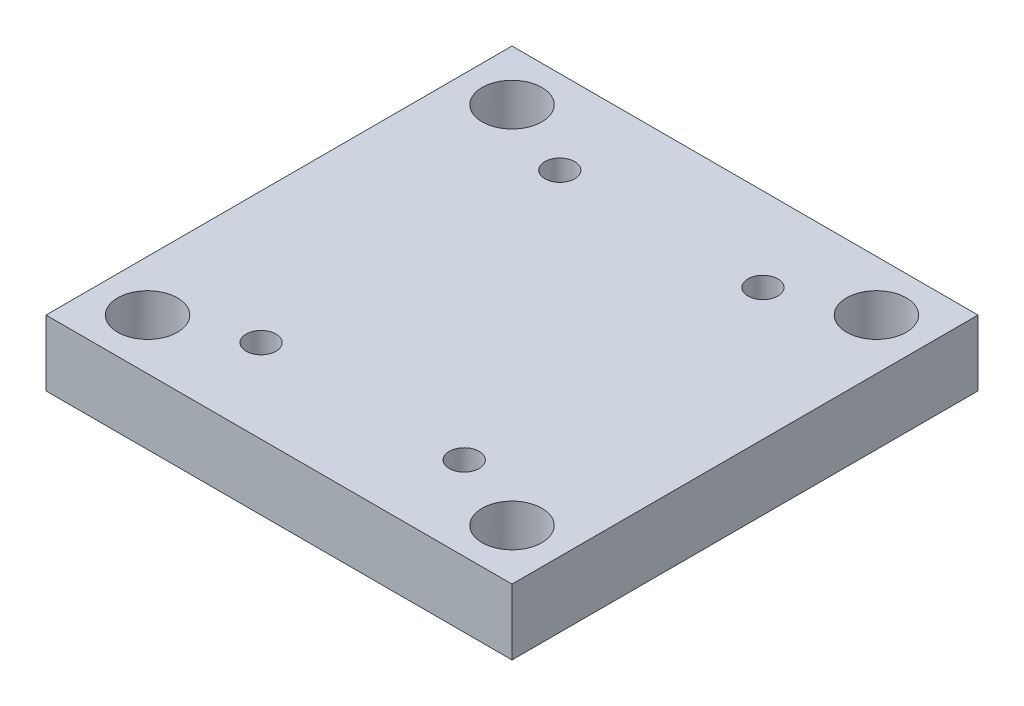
ISO-10303-21;
HEADER;
FILE_DESCRIPTION(('STEP AP214'),'2;1');
FILE_NAME('part.step','',(''),(''),'','','');
FILE_SCHEMA(('AUTOMOTIVE_DESIGN { 1 0 10303 214 1 1 1 1 }'));
ENDSEC;
DATA;
#1=APPLICATION_CONTEXT('core data for automotive mechanical design processes');
#2=APPLICATION_PROTOCOL_DEFINITION('international standard','automotive_design',2000,#1);
#3=PRODUCT_CONTEXT('',#1,'mechanical');
#4=PRODUCT('Part','Part','',(#3));
#5=PRODUCT_RELATED_PRODUCT_CATEGORY('part','',(#4));
#6=PRODUCT_DEFINITION_FORMATION('','',#4);
#7=PRODUCT_DEFINITION_CONTEXT('part definition',#1,'design');
#8=PRODUCT_DEFINITION('design','',#6,#7);
#9=PRODUCT_DEFINITION_SHAPE('','',#8);
#10=(LENGTH_UNIT() NAMED_UNIT(*) SI_UNIT(.MILLI.,.METRE.));
#11=(NAMED_UNIT(*) PLANE_ANGLE_UNIT() SI_UNIT($,.RADIAN.));
#12=(NAMED_UNIT(*) SI_UNIT($,.STERADIAN.) SOLID_ANGLE_UNIT());
#13=UNCERTAINTY_MEASURE_WITH_UNIT(LENGTH_MEASURE(1.E-05),#10,'distance_accuracy_value','');
#14=(GEOMETRIC_REPRESENTATION_CONTEXT(3) GLOBAL_UNCERTAINTY_ASSIGNED_CONTEXT((#13)) GLOBAL_UNIT_ASSIGNED_CONTEXT((#10,
#11,#12)) REPRESENTATION_CONTEXT('',''));
#15=CARTESIAN_POINT('',(0.,0.,0.));
#16=DIRECTION('',(0.,0.,1.));
#17=DIRECTION('',(1.,0.,0.));
#18=AXIS2_PLACEMENT_3D('',#15,#16,#17);
#19=CARTESIAN_POINT('',(61.,0.,-61.));
#20=DIRECTION('',(0.,1.,0.));
#21=DIRECTION('',(0.,0.,1.));
#22=AXIS2_PLACEMENT_3D('',#19,#20,#21);
#23=CYLINDRICAL_SURFACE('',#22,9.99999999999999);
#24=CARTESIAN_POINT('',(61.,22.,-61.));
#25=DIRECTION('',(0.,1.,0.));
#26=DIRECTION('',(0.,0.,1.));
#27=AXIS2_PLACEMENT_3D('',#24,#25,#26);
#28=CIRCLE('',#27,9.99999999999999);
#29=CARTESIAN_POINT('',(61.,22.,-51.));
#30=VERTEX_POINT('',#29);
#31=EDGE_CURVE('E110',#30,#30,#28,.T.);
#32=ORIENTED_EDGE('',*,*,#31,.T.);
#33=EDGE_LOOP('',(#32));
#34=FACE_BOUND('',#33,.T.);
#35=CARTESIAN_POINT('',(61.,6.,-61.));
#36=DIRECTION('',(0.,-1.,0.));
#37=DIRECTION('',(0.,0.,-1.));
#38=AXIS2_PLACEMENT_3D('',#35,#36,#37);
#39=CIRCLE('',#38,9.99999999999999);
#40=CARTESIAN_POINT('',(61.,6.,-71.));
#41=VERTEX_POINT('',#40);
#42=EDGE_CURVE('E35',#41,#41,#39,.F.);
#43=ORIENTED_EDGE('',*,*,#42,.F.);
#44=EDGE_LOOP('',(#43));
#45=FACE_BOUND('',#44,.T.);
#46=ADVANCED_FACE('F31',(#34,#45),#23,.F.);
#47=CARTESIAN_POINT('',(-61.,0.,-61.));
#48=DIRECTION('',(0.,1.,0.));
#49=DIRECTION('',(0.,0.,1.));
#50=AXIS2_PLACEMENT_3D('',#47,#48,#49);
#51=CYLINDRICAL_SURFACE('',#50,10.);
#52=CARTESIAN_POINT('',(-61.,22.,-61.));
#53=DIRECTION('',(0.,1.,0.));
#54=DIRECTION('',(0.,0.,1.));
#55=AXIS2_PLACEMENT_3D('',#52,#53,#54);
#56=CIRCLE('',#55,10.);
#57=CARTESIAN_POINT('',(-61.,22.,-51.));
#58=VERTEX_POINT('',#57);
#59=EDGE_CURVE('E143',#58,#58,#56,.T.);
#60=ORIENTED_EDGE('',*,*,#59,.T.);
#61=EDGE_LOOP('',(#60));
#62=FACE_BOUND('',#61,.T.);
#63=CARTESIAN_POINT('',(-61.,6.,-61.));
#64=DIRECTION('',(0.,-1.,0.));
#65=DIRECTION('',(0.,0.,-1.));
#66=AXIS2_PLACEMENT_3D('',#63,#64,#65);
#67=CIRCLE('',#66,10.);
#68=CARTESIAN_POINT('',(-61.,6.,-71.));
#69=VERTEX_POINT('',#68);
#70=EDGE_CURVE('E116',#69,#69,#67,.F.);
#71=ORIENTED_EDGE('',*,*,#70,.F.);
#72=EDGE_LOOP('',(#71));
#73=FACE_BOUND('',#72,.T.);
#74=ADVANCED_FACE('F173',(#62,#73),#51,.F.);
#75=CARTESIAN_POINT('',(-61.,0.,61.));
#76=DIRECTION('',(0.,1.,0.));
#77=DIRECTION('',(0.,0.,1.));
#78=AXIS2_PLACEMENT_3D('',#75,#76,#77);
#79=CYLINDRICAL_SURFACE('',#78,10.);
#80=CARTESIAN_POINT('',(-61.,22.,61.));
#81=DIRECTION('',(0.,1.,0.));
#82=DIRECTION('',(0.,0.,1.));
#83=AXIS2_PLACEMENT_3D('',#80,#81,#82);
#84=CIRCLE('',#83,10.);
#85=CARTESIAN_POINT('',(-61.,22.,71.));
#86=VERTEX_POINT('',#85);
#87=EDGE_CURVE('E146',#86,#86,#84,.T.);
#88=ORIENTED_EDGE('',*,*,#87,.T.);
#89=EDGE_LOOP('',(#88));
#90=FACE_BOUND('',#89,.T.);
#91=CARTESIAN_POINT('',(-61.,6.,61.));
#92=DIRECTION('',(0.,-1.,0.));
#93=DIRECTION('',(0.,0.,-1.));
#94=AXIS2_PLACEMENT_3D('',#91,#92,#93);
#95=CIRCLE('',#94,10.);
#96=CARTESIAN_POINT('',(-61.,6.,51.));
#97=VERTEX_POINT('',#96);
#98=EDGE_CURVE('E112',#97,#97,#95,.F.);
#99=ORIENTED_EDGE('',*,*,#98,.F.);
#100=EDGE_LOOP('',(#99));
#101=FACE_BOUND('',#100,.T.);
#102=ADVANCED_FACE('F180',(#90,#101),#79,.F.);
#103=CARTESIAN_POINT('',(61.,0.,61.));
#104=DIRECTION('',(0.,1.,0.));
#105=DIRECTION('',(0.,0.,1.));
#106=AXIS2_PLACEMENT_3D('',#103,#104,#105);
#107=CYLINDRICAL_SURFACE('',#106,10.);
#108=CARTESIAN_POINT('',(61.,22.,61.));
#109=DIRECTION('',(0.,1.,0.));
#110=DIRECTION('',(0.,0.,1.));
#111=AXIS2_PLACEMENT_3D('',#108,#109,#110);
#112=CIRCLE('',#111,10.);
#113=CARTESIAN_POINT('',(61.,22.,71.));
#114=VERTEX_POINT('',#113);
#115=EDGE_CURVE('E101',#114,#114,#112,.T.);
#116=ORIENTED_EDGE('',*,*,#115,.T.);
#117=EDGE_LOOP('',(#116));
#118=FACE_BOUND('',#117,.T.);
#119=CARTESIAN_POINT('',(61.,6.,61.));
#120=DIRECTION('',(0.,-1.,0.));
#121=DIRECTION('',(0.,0.,-1.));
#122=AXIS2_PLACEMENT_3D('',#119,#120,#121);
#123=CIRCLE('',#122,10.);
#124=CARTESIAN_POINT('',(61.,6.,51.));
#125=VERTEX_POINT('',#124);
#126=EDGE_CURVE('E107',#125,#125,#123,.F.);
#127=ORIENTED_EDGE('',*,*,#126,.F.);
#128=EDGE_LOOP('',(#127));
#129=FACE_BOUND('',#128,.T.);
#130=ADVANCED_FACE('F152',(#118,#129),#107,.F.);
#131=CARTESIAN_POINT('',(78.,22.,78.));
#132=DIRECTION('',(-1.,0.,0.));
#133=DIRECTION('',(0.,0.,1.));
#134=AXIS2_PLACEMENT_3D('',#131,#132,#133);
#135=PLANE('',#134);
#136=DIRECTION('',(0.,0.,-1.));
#137=VECTOR('',#136,1.);
#138=CARTESIAN_POINT('',(78.,0.,78.));
#139=LINE('',#138,#137);
#140=CARTESIAN_POINT('',(78.,0.,78.));
#141=VERTEX_POINT('',#140);
#142=CARTESIAN_POINT('',(78.,0.,-78.));
#143=VERTEX_POINT('',#142);
#144=EDGE_CURVE('E98',#141,#143,#139,.T.);
#145=ORIENTED_EDGE('',*,*,#144,.T.);
#146=DIRECTION('',(0.,-1.,0.));
#147=VECTOR('',#146,1.);
#148=CARTESIAN_POINT('',(78.,22.,-78.));
#149=LINE('',#148,#147);
#150=CARTESIAN_POINT('',(78.,22.,-78.));
#151=VERTEX_POINT('',#150);
#152=EDGE_CURVE('E11',#151,#143,#149,.T.);
#153=ORIENTED_EDGE('',*,*,#152,.F.);
#154=DIRECTION('',(0.,0.,-1.));
#155=VECTOR('',#154,1.);
#156=CARTESIAN_POINT('',(78.,22.,78.));
#157=LINE('',#156,#155);
#158=CARTESIAN_POINT('',(78.,22.,78.));
#159=VERTEX_POINT('',#158);
#160=EDGE_CURVE('E85',#159,#151,#157,.T.);
#161=ORIENTED_EDGE('',*,*,#160,.F.);
#162=DIRECTION('',(0.,-1.,0.));
#163=VECTOR('',#162,1.);
#164=CARTESIAN_POINT('',(78.,22.,78.));
#165=LINE('',#164,#163);
#166=EDGE_CURVE('E94',#159,#141,#165,.T.);
#167=ORIENTED_EDGE('',*,*,#166,.T.);
#168=EDGE_LOOP('',(#145,#153,#161,#167));
#169=FACE_BOUND('',#168,.T.);
#170=ADVANCED_FACE('F33',(#169),#135,.F.);
#171=CARTESIAN_POINT('',(-78.,22.,-78.));
#172=DIRECTION('',(0.,0.,1.));
#173=DIRECTION('',(1.,0.,0.));
#174=AXIS2_PLACEMENT_3D('',#171,#172,#173);
#175=PLANE('',#174);
#176=DIRECTION('',(-1.,0.,0.));
#177=VECTOR('',#176,1.);
#178=CARTESIAN_POINT('',(-78.,0.,-78.));
#179=LINE('',#178,#177);
#180=CARTESIAN_POINT('',(-78.,0.,-78.));
#181=VERTEX_POINT('',#180);
#182=EDGE_CURVE('E89',#143,#181,#179,.T.);
#183=ORIENTED_EDGE('',*,*,#182,.T.);
#184=DIRECTION('',(0.,-1.,0.));
#185=VECTOR('',#184,1.);
#186=CARTESIAN_POINT('',(-78.,22.,-78.));
#187=LINE('',#186,#185);
#188=CARTESIAN_POINT('',(-78.,22.,-78.));
#189=VERTEX_POINT('',#188);
#190=EDGE_CURVE('E41',#189,#181,#187,.T.);
#191=ORIENTED_EDGE('',*,*,#190,.F.);
#192=DIRECTION('',(-1.,0.,0.));
#193=VECTOR('',#192,1.);
#194=CARTESIAN_POINT('',(-78.,22.,-78.));
#195=LINE('',#194,#193);
#196=EDGE_CURVE('E80',#151,#189,#195,.T.);
#197=ORIENTED_EDGE('',*,*,#196,.F.);
#198=ORIENTED_EDGE('',*,*,#152,.T.);
#199=EDGE_LOOP('',(#183,#191,#197,#198));
#200=FACE_BOUND('',#199,.T.);
#201=ADVANCED_FACE('F88',(#200),#175,.F.);
#202=CARTESIAN_POINT('',(-78.,22.,78.));
#203=DIRECTION('',(1.,0.,0.));
#204=DIRECTION('',(0.,0.,-1.));
#205=AXIS2_PLACEMENT_3D('',#202,#203,#204);
#206=PLANE('',#205);
#207=DIRECTION('',(0.,0.,1.));
#208=VECTOR('',#207,1.);
#209=CARTESIAN_POINT('',(-78.,0.,78.));
#210=LINE('',#209,#208);
#211=CARTESIAN_POINT('',(-78.,0.,78.));
#212=VERTEX_POINT('',#211);
#213=EDGE_CURVE('E67',#181,#212,#210,.T.);
#214=ORIENTED_EDGE('',*,*,#213,.T.);
#215=DIRECTION('',(0.,-1.,0.));
#216=VECTOR('',#215,1.);
#217=CARTESIAN_POINT('',(-78.,22.,78.));
#218=LINE('',#217,#216);
#219=CARTESIAN_POINT('',(-78.,22.,78.));
#220=VERTEX_POINT('',#219);
#221=EDGE_CURVE('E90',#220,#212,#218,.T.);
#222=ORIENTED_EDGE('',*,*,#221,.F.);
#223=DIRECTION('',(0.,0.,1.));
#224=VECTOR('',#223,1.);
#225=CARTESIAN_POINT('',(-78.,22.,78.));
#226=LINE('',#225,#224);
#227=EDGE_CURVE('E83',#189,#220,#226,.T.);
#228=ORIENTED_EDGE('',*,*,#227,.F.);
#229=ORIENTED_EDGE('',*,*,#190,.T.);
#230=EDGE_LOOP('',(#214,#222,#228,#229));
#231=FACE_BOUND('',#230,.T.);
#232=ADVANCED_FACE('F92',(#231),#206,.F.);
#233=CARTESIAN_POINT('',(-78.,22.,78.));
#234=DIRECTION('',(0.,0.,-1.));
#235=DIRECTION('',(-1.,0.,0.));
#236=AXIS2_PLACEMENT_3D('',#233,#234,#235);
#237=PLANE('',#236);
#238=DIRECTION('',(1.,0.,0.));
#239=VECTOR('',#238,1.);
#240=CARTESIAN_POINT('',(-78.,0.,78.));
#241=LINE('',#240,#239);
#242=EDGE_CURVE('E73',#212,#141,#241,.T.);
#243=ORIENTED_EDGE('',*,*,#242,.T.);
#244=ORIENTED_EDGE('',*,*,#166,.F.);
#245=DIRECTION('',(1.,0.,0.));
#246=VECTOR('',#245,1.);
#247=CARTESIAN_POINT('',(-78.,22.,78.));
#248=LINE('',#247,#246);
#249=EDGE_CURVE('E50',#220,#159,#248,.T.);
#250=ORIENTED_EDGE('',*,*,#249,.F.);
#251=ORIENTED_EDGE('',*,*,#221,.T.);
#252=EDGE_LOOP('',(#243,#244,#250,#251));
#253=FACE_BOUND('',#252,.T.);
#254=ADVANCED_FACE('F157',(#253),#237,.F.);
#255=CARTESIAN_POINT('',(78.,22.,-78.));
#256=DIRECTION('',(0.,-1.,0.));
#257=DIRECTION('',(0.,0.,-1.));
#258=AXIS2_PLACEMENT_3D('',#255,#256,#257);
#259=PLANE('',#258);
#260=CARTESIAN_POINT('',(-34.0000000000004,22.,49.9999999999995));
#261=DIRECTION('',(0.,-1.,0.));
#262=DIRECTION('',(0.,0.,-1.));
#263=AXIS2_PLACEMENT_3D('',#260,#261,#262);
#264=CIRCLE('',#263,5.);
#265=CARTESIAN_POINT('',(-34.0000000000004,22.,44.9999999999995));
#266=VERTEX_POINT('',#265);
#267=EDGE_CURVE('E399',#266,#266,#264,.T.);
#268=ORIENTED_EDGE('',*,*,#267,.T.);
#269=EDGE_LOOP('',(#268));
#270=FACE_BOUND('',#269,.T.);
#271=CARTESIAN_POINT('',(33.9999999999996,22.,50.));
#272=DIRECTION('',(0.,-1.,0.));
#273=DIRECTION('',(0.,0.,-1.));
#274=AXIS2_PLACEMENT_3D('',#271,#272,#273);
#275=CIRCLE('',#274,5.);
#276=CARTESIAN_POINT('',(33.9999999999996,22.,45.));
#277=VERTEX_POINT('',#276);
#278=EDGE_CURVE('E393',#277,#277,#275,.T.);
#279=ORIENTED_EDGE('',*,*,#278,.T.);
#280=EDGE_LOOP('',(#279));
#281=FACE_BOUND('',#280,.T.);
#282=CARTESIAN_POINT('',(-34.,22.,-50.0000000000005));
#283=DIRECTION('',(0.,-1.,0.));
#284=DIRECTION('',(0.,0.,-1.));
#285=AXIS2_PLACEMENT_3D('',#282,#283,#284);
#286=CIRCLE('',#285,5.);
#287=CARTESIAN_POINT('',(-34.,22.,-55.0000000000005));
#288=VERTEX_POINT('',#287);
#289=EDGE_CURVE('E387',#288,#288,#286,.T.);
#290=ORIENTED_EDGE('',*,*,#289,.T.);
#291=EDGE_LOOP('',(#290));
#292=FACE_BOUND('',#291,.T.);
#293=CARTESIAN_POINT('',(34.,22.,-50.));
#294=DIRECTION('',(0.,-1.,0.));
#295=DIRECTION('',(0.,0.,-1.));
#296=AXIS2_PLACEMENT_3D('',#293,#294,#295);
#297=CIRCLE('',#296,5.);
#298=CARTESIAN_POINT('',(34.,22.,-55.));
#299=VERTEX_POINT('',#298);
#300=EDGE_CURVE('E380',#299,#299,#297,.T.);
#301=ORIENTED_EDGE('',*,*,#300,.T.);
#302=EDGE_LOOP('',(#301));
#303=FACE_BOUND('',#302,.T.);
#304=ORIENTED_EDGE('',*,*,#31,.F.);
#305=EDGE_LOOP('',(#304));
#306=FACE_BOUND('',#305,.T.);
#307=ORIENTED_EDGE('',*,*,#59,.F.);
#308=EDGE_LOOP('',(#307));
#309=FACE_BOUND('',#308,.T.);
#310=ORIENTED_EDGE('',*,*,#87,.F.);
#311=EDGE_LOOP('',(#310));
#312=FACE_BOUND('',#311,.T.);
#313=ORIENTED_EDGE('',*,*,#115,.F.);
#314=EDGE_LOOP('',(#313));
#315=FACE_BOUND('',#314,.T.);
#316=ORIENTED_EDGE('',*,*,#160,.T.);
#317=ORIENTED_EDGE('',*,*,#196,.T.);
#318=ORIENTED_EDGE('',*,*,#227,.T.);
#319=ORIENTED_EDGE('',*,*,#249,.T.);
#320=EDGE_LOOP('',(#316,#317,#318,#319));
#321=FACE_BOUND('',#320,.T.);
#322=ADVANCED_FACE('F81',(#270,#281,#292,#303,#306,#309,#312,#315,#321),#259,.F.);
#323=CARTESIAN_POINT('',(78.,0.,-78.));
#324=DIRECTION('',(0.,-1.,0.));
#325=DIRECTION('',(0.,0.,-1.));
#326=AXIS2_PLACEMENT_3D('',#323,#324,#325);
#327=PLANE('',#326);
#328=CARTESIAN_POINT('',(-34.0000000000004,0.,49.9999999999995));
#329=DIRECTION('',(0.,-1.,0.));
#330=DIRECTION('',(0.,0.,-1.));
#331=AXIS2_PLACEMENT_3D('',#328,#329,#330);
#332=CIRCLE('',#331,5.);
#333=CARTESIAN_POINT('',(-34.0000000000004,0.,44.9999999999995));
#334=VERTEX_POINT('',#333);
#335=EDGE_CURVE('E402',#334,#334,#332,.T.);
#336=ORIENTED_EDGE('',*,*,#335,.F.);
#337=EDGE_LOOP('',(#336));
#338=FACE_BOUND('',#337,.T.);
#339=CARTESIAN_POINT('',(33.9999999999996,0.,50.));
#340=DIRECTION('',(0.,-1.,0.));
#341=DIRECTION('',(0.,0.,-1.));
#342=AXIS2_PLACEMENT_3D('',#339,#340,#341);
#343=CIRCLE('',#342,5.);
#344=CARTESIAN_POINT('',(33.9999999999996,0.,45.));
#345=VERTEX_POINT('',#344);
#346=EDGE_CURVE('E396',#345,#345,#343,.T.);
#347=ORIENTED_EDGE('',*,*,#346,.F.);
#348=EDGE_LOOP('',(#347));
#349=FACE_BOUND('',#348,.T.);
#350=CARTESIAN_POINT('',(-34.,0.,-50.0000000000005));
#351=DIRECTION('',(0.,-1.,0.));
#352=DIRECTION('',(0.,0.,-1.));
#353=AXIS2_PLACEMENT_3D('',#350,#351,#352);
#354=CIRCLE('',#353,5.);
#355=CARTESIAN_POINT('',(-34.,0.,-55.0000000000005));
#356=VERTEX_POINT('',#355);
#357=EDGE_CURVE('E390',#356,#356,#354,.T.);
#358=ORIENTED_EDGE('',*,*,#357,.F.);
#359=EDGE_LOOP('',(#358));
#360=FACE_BOUND('',#359,.T.);
#361=CARTESIAN_POINT('',(34.,0.,-50.));
#362=DIRECTION('',(0.,-1.,0.));
#363=DIRECTION('',(0.,0.,-1.));
#364=AXIS2_PLACEMENT_3D('',#361,#362,#363);
#365=CIRCLE('',#364,5.);
#366=CARTESIAN_POINT('',(34.,0.,-55.));
#367=VERTEX_POINT('',#366);
#368=EDGE_CURVE('E382',#367,#367,#365,.T.);
#369=ORIENTED_EDGE('',*,*,#368,.F.);
#370=EDGE_LOOP('',(#369));
#371=FACE_BOUND('',#370,.T.);
#372=CARTESIAN_POINT('',(61.,0.,-61.));
#373=DIRECTION('',(0.,-1.,0.));
#374=DIRECTION('',(0.,0.,-1.));
#375=AXIS2_PLACEMENT_3D('',#372,#373,#374);
#376=CIRCLE('',#375,12.5);
#377=CARTESIAN_POINT('',(61.,0.,-73.5));
#378=VERTEX_POINT('',#377);
#379=EDGE_CURVE('E132',#378,#378,#376,.T.);
#380=ORIENTED_EDGE('',*,*,#379,.F.);
#381=EDGE_LOOP('',(#380));
#382=FACE_BOUND('',#381,.T.);
#383=CARTESIAN_POINT('',(-61.,0.,-61.));
#384=DIRECTION('',(0.,-1.,0.));
#385=DIRECTION('',(0.,0.,-1.));
#386=AXIS2_PLACEMENT_3D('',#383,#384,#385);
#387=CIRCLE('',#386,12.5);
#388=CARTESIAN_POINT('',(-61.,0.,-73.5));
#389=VERTEX_POINT('',#388);
#390=EDGE_CURVE('E125',#389,#389,#387,.T.);
#391=ORIENTED_EDGE('',*,*,#390,.F.);
#392=EDGE_LOOP('',(#391));
#393=FACE_BOUND('',#392,.T.);
#394=CARTESIAN_POINT('',(-61.,0.,61.));
#395=DIRECTION('',(0.,-1.,0.));
#396=DIRECTION('',(0.,0.,-1.));
#397=AXIS2_PLACEMENT_3D('',#394,#395,#396);
#398=CIRCLE('',#397,12.5);
#399=CARTESIAN_POINT('',(-61.,0.,48.5));
#400=VERTEX_POINT('',#399);
#401=EDGE_CURVE('E118',#400,#400,#398,.T.);
#402=ORIENTED_EDGE('',*,*,#401,.F.);
#403=EDGE_LOOP('',(#402));
#404=FACE_BOUND('',#403,.T.);
#405=CARTESIAN_POINT('',(61.,0.,61.));
#406=DIRECTION('',(0.,-1.,0.));
#407=DIRECTION('',(0.,0.,-1.));
#408=AXIS2_PLACEMENT_3D('',#405,#406,#407);
#409=CIRCLE('',#408,12.5);
#410=CARTESIAN_POINT('',(61.,0.,48.5));
#411=VERTEX_POINT('',#410);
#412=EDGE_CURVE('E114',#411,#411,#409,.T.);
#413=ORIENTED_EDGE('',*,*,#412,.F.);
#414=EDGE_LOOP('',(#413));
#415=FACE_BOUND('',#414,.T.);
#416=ORIENTED_EDGE('',*,*,#144,.F.);
#417=ORIENTED_EDGE('',*,*,#242,.F.);
#418=ORIENTED_EDGE('',*,*,#213,.F.);
#419=ORIENTED_EDGE('',*,*,#182,.F.);
#420=EDGE_LOOP('',(#416,#417,#418,#419));
#421=FACE_BOUND('',#420,.T.);
#422=ADVANCED_FACE('F156',(#338,#349,#360,#371,#382,#393,#404,#415,#421),#327,.T.);
#423=CARTESIAN_POINT('',(61.,6.,61.));
#424=DIRECTION('',(0.,-1.,0.));
#425=DIRECTION('',(0.,0.,-1.));
#426=AXIS2_PLACEMENT_3D('',#423,#424,#425);
#427=PLANE('',#426);
#428=CARTESIAN_POINT('',(61.,6.,61.));
#429=DIRECTION('',(0.,-1.,0.));
#430=DIRECTION('',(0.,0.,-1.));
#431=AXIS2_PLACEMENT_3D('',#428,#429,#430);
#432=CIRCLE('',#431,12.5);
#433=CARTESIAN_POINT('',(61.,6.,48.5));
#434=VERTEX_POINT('',#433);
#435=EDGE_CURVE('E111',#434,#434,#432,.T.);
#436=ORIENTED_EDGE('',*,*,#435,.T.);
#437=EDGE_LOOP('',(#436));
#438=FACE_BOUND('',#437,.T.);
#439=ORIENTED_EDGE('',*,*,#126,.T.);
#440=EDGE_LOOP('',(#439));
#441=FACE_BOUND('',#440,.T.);
#442=ADVANCED_FACE('F164',(#438,#441),#427,.T.);
#443=CARTESIAN_POINT('',(61.,6.,61.));
#444=DIRECTION('',(0.,-1.,0.));
#445=DIRECTION('',(0.,0.,-1.));
#446=AXIS2_PLACEMENT_3D('',#443,#444,#445);
#447=CYLINDRICAL_SURFACE('',#446,12.5);
#448=ORIENTED_EDGE('',*,*,#435,.F.);
#449=EDGE_LOOP('',(#448));
#450=FACE_BOUND('',#449,.T.);
#451=ORIENTED_EDGE('',*,*,#412,.T.);
#452=EDGE_LOOP('',(#451));
#453=FACE_BOUND('',#452,.T.);
#454=ADVANCED_FACE('F185',(#450,#453),#447,.F.);
#455=CARTESIAN_POINT('',(-61.,6.,61.));
#456=DIRECTION('',(0.,-1.,0.));
#457=DIRECTION('',(0.,0.,-1.));
#458=AXIS2_PLACEMENT_3D('',#455,#456,#457);
#459=PLANE('',#458);
#460=CARTESIAN_POINT('',(-61.,6.,61.));
#461=DIRECTION('',(0.,-1.,0.));
#462=DIRECTION('',(0.,0.,-1.));
#463=AXIS2_PLACEMENT_3D('',#460,#461,#462);
#464=CIRCLE('',#463,12.5);
#465=CARTESIAN_POINT('',(-61.,6.,48.5));
#466=VERTEX_POINT('',#465);
#467=EDGE_CURVE('E115',#466,#466,#464,.T.);
#468=ORIENTED_EDGE('',*,*,#467,.T.);
#469=EDGE_LOOP('',(#468));
#470=FACE_BOUND('',#469,.T.);
#471=ORIENTED_EDGE('',*,*,#98,.T.);
#472=EDGE_LOOP('',(#471));
#473=FACE_BOUND('',#472,.T.);
#474=ADVANCED_FACE('F283',(#470,#473),#459,.T.);
#475=CARTESIAN_POINT('',(-61.,6.,61.));
#476=DIRECTION('',(0.,-1.,0.));
#477=DIRECTION('',(0.,0.,-1.));
#478=AXIS2_PLACEMENT_3D('',#475,#476,#477);
#479=CYLINDRICAL_SURFACE('',#478,12.5);
#480=ORIENTED_EDGE('',*,*,#467,.F.);
#481=EDGE_LOOP('',(#480));
#482=FACE_BOUND('',#481,.T.);
#483=ORIENTED_EDGE('',*,*,#401,.T.);
#484=EDGE_LOOP('',(#483));
#485=FACE_BOUND('',#484,.T.);
#486=ADVANCED_FACE('F279',(#482,#485),#479,.F.);
#487=CARTESIAN_POINT('',(-61.,6.,-61.));
#488=DIRECTION('',(0.,-1.,0.));
#489=DIRECTION('',(0.,0.,-1.));
#490=AXIS2_PLACEMENT_3D('',#487,#488,#489);
#491=PLANE('',#490);
#492=CARTESIAN_POINT('',(-61.,6.,-61.));
#493=DIRECTION('',(0.,-1.,0.));
#494=DIRECTION('',(0.,0.,-1.));
#495=AXIS2_PLACEMENT_3D('',#492,#493,#494);
#496=CIRCLE('',#495,12.5);
#497=CARTESIAN_POINT('',(-61.,6.,-73.5));
#498=VERTEX_POINT('',#497);
#499=EDGE_CURVE('E119',#498,#498,#496,.T.);
#500=ORIENTED_EDGE('',*,*,#499,.T.);
#501=EDGE_LOOP('',(#500));
#502=FACE_BOUND('',#501,.T.);
#503=ORIENTED_EDGE('',*,*,#70,.T.);
#504=EDGE_LOOP('',(#503));
#505=FACE_BOUND('',#504,.T.);
#506=ADVANCED_FACE('F276',(#502,#505),#491,.T.);
#507=CARTESIAN_POINT('',(-61.,6.,-61.));
#508=DIRECTION('',(0.,-1.,0.));
#509=DIRECTION('',(0.,0.,-1.));
#510=AXIS2_PLACEMENT_3D('',#507,#508,#509);
#511=CYLINDRICAL_SURFACE('',#510,12.5);
#512=ORIENTED_EDGE('',*,*,#499,.F.);
#513=EDGE_LOOP('',(#512));
#514=FACE_BOUND('',#513,.T.);
#515=ORIENTED_EDGE('',*,*,#390,.T.);
#516=EDGE_LOOP('',(#515));
#517=FACE_BOUND('',#516,.T.);
#518=ADVANCED_FACE('F272',(#514,#517),#511,.F.);
#519=CARTESIAN_POINT('',(61.,6.,-61.));
#520=DIRECTION('',(0.,-1.,0.));
#521=DIRECTION('',(0.,0.,-1.));
#522=AXIS2_PLACEMENT_3D('',#519,#520,#521);
#523=PLANE('',#522);
#524=CARTESIAN_POINT('',(61.,6.,-61.));
#525=DIRECTION('',(0.,-1.,0.));
#526=DIRECTION('',(0.,0.,-1.));
#527=AXIS2_PLACEMENT_3D('',#524,#525,#526);
#528=CIRCLE('',#527,12.5);
#529=CARTESIAN_POINT('',(61.,6.,-73.5));
#530=VERTEX_POINT('',#529);
#531=EDGE_CURVE('E376',#530,#530,#528,.T.);
#532=ORIENTED_EDGE('',*,*,#531,.T.);
#533=EDGE_LOOP('',(#532));
#534=FACE_BOUND('',#533,.T.);
#535=ORIENTED_EDGE('',*,*,#42,.T.);
#536=EDGE_LOOP('',(#535));
#537=FACE_BOUND('',#536,.T.);
#538=ADVANCED_FACE('F269',(#534,#537),#523,.T.);
#539=CARTESIAN_POINT('',(61.,6.,-61.));
#540=DIRECTION('',(0.,-1.,0.));
#541=DIRECTION('',(0.,0.,-1.));
#542=AXIS2_PLACEMENT_3D('',#539,#540,#541);
#543=CYLINDRICAL_SURFACE('',#542,12.5);
#544=ORIENTED_EDGE('',*,*,#531,.F.);
#545=EDGE_LOOP('',(#544));
#546=FACE_BOUND('',#545,.T.);
#547=ORIENTED_EDGE('',*,*,#379,.T.);
#548=EDGE_LOOP('',(#547));
#549=FACE_BOUND('',#548,.T.);
#550=ADVANCED_FACE('F230',(#546,#549),#543,.F.);
#551=CARTESIAN_POINT('',(34.,22.,-50.));
#552=DIRECTION('',(0.,-1.,0.));
#553=DIRECTION('',(0.,0.,-1.));
#554=AXIS2_PLACEMENT_3D('',#551,#552,#553);
#555=CYLINDRICAL_SURFACE('',#554,5.);
#556=ORIENTED_EDGE('',*,*,#300,.F.);
#557=EDGE_LOOP('',(#556));
#558=FACE_BOUND('',#557,.T.);
#559=ORIENTED_EDGE('',*,*,#368,.T.);
#560=EDGE_LOOP('',(#559));
#561=FACE_BOUND('',#560,.T.);
#562=ADVANCED_FACE('F224',(#558,#561),#555,.F.);
#563=CARTESIAN_POINT('',(-34.,22.,-50.0000000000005));
#564=DIRECTION('',(0.,-1.,0.));
#565=DIRECTION('',(0.,0.,-1.));
#566=AXIS2_PLACEMENT_3D('',#563,#564,#565);
#567=CYLINDRICAL_SURFACE('',#566,5.);
#568=ORIENTED_EDGE('',*,*,#289,.F.);
#569=EDGE_LOOP('',(#568));
#570=FACE_BOUND('',#569,.T.);
#571=ORIENTED_EDGE('',*,*,#357,.T.);
#572=EDGE_LOOP('',(#571));
#573=FACE_BOUND('',#572,.T.);
#574=ADVANCED_FACE('F229',(#570,#573),#567,.F.);
#575=CARTESIAN_POINT('',(33.9999999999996,22.,50.));
#576=DIRECTION('',(0.,-1.,0.));
#577=DIRECTION('',(0.,0.,-1.));
#578=AXIS2_PLACEMENT_3D('',#575,#576,#577);
#579=CYLINDRICAL_SURFACE('',#578,5.);
#580=ORIENTED_EDGE('',*,*,#278,.F.);
#581=EDGE_LOOP('',(#580));
#582=FACE_BOUND('',#581,.T.);
#583=ORIENTED_EDGE('',*,*,#346,.T.);
#584=EDGE_LOOP('',(#583));
#585=FACE_BOUND('',#584,.T.);
#586=ADVANCED_FACE('F242',(#582,#585),#579,.F.);
#587=CARTESIAN_POINT('',(-34.0000000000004,22.,49.9999999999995));
#588=DIRECTION('',(0.,-1.,0.));
#589=DIRECTION('',(0.,0.,-1.));
#590=AXIS2_PLACEMENT_3D('',#587,#588,#589);
#591=CYLINDRICAL_SURFACE('',#590,5.);
#592=ORIENTED_EDGE('',*,*,#267,.F.);
#593=EDGE_LOOP('',(#592));
#594=FACE_BOUND('',#593,.T.);
#595=ORIENTED_EDGE('',*,*,#335,.T.);
#596=EDGE_LOOP('',(#595));
#597=FACE_BOUND('',#596,.T.);
#598=ADVANCED_FACE('F252',(#594,#597),#591,.F.);
#599=CLOSED_SHELL('',(#46,#74,#102,#130,#170,#201,#232,#254,#322,#422,#442,#454,#474,#486,#506,
#518,#538,#550,#562,#574,#586,#598));
#600=MANIFOLD_SOLID_BREP('B2',#599);
#601=ADVANCED_BREP_SHAPE_REPRESENTATION('',(#18,#600),#14);
#602=SHAPE_DEFINITION_REPRESENTATION(#9,#601);
ENDSEC;
END-ISO-10303-21;
